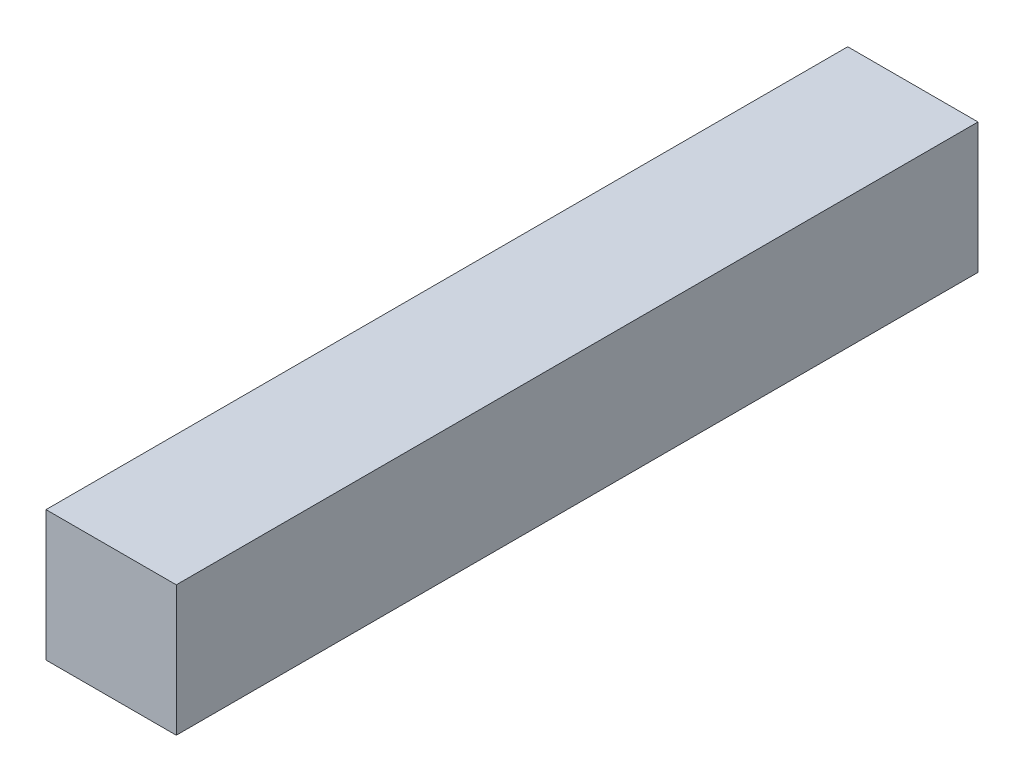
ISO-10303-21;
HEADER;
FILE_DESCRIPTION(('STEP AP214'),'2;1');
FILE_NAME('part.step','',(''),(''),'','','');
FILE_SCHEMA(('AUTOMOTIVE_DESIGN { 1 0 10303 214 1 1 1 1 }'));
ENDSEC;
DATA;
#1=APPLICATION_CONTEXT('core data for automotive mechanical design processes');
#2=APPLICATION_PROTOCOL_DEFINITION('international standard','automotive_design',2000,#1);
#3=PRODUCT_CONTEXT('',#1,'mechanical');
#4=PRODUCT('Part','Part','',(#3));
#5=PRODUCT_RELATED_PRODUCT_CATEGORY('part','',(#4));
#6=PRODUCT_DEFINITION_FORMATION('','',#4);
#7=PRODUCT_DEFINITION_CONTEXT('part definition',#1,'design');
#8=PRODUCT_DEFINITION('design','',#6,#7);
#9=PRODUCT_DEFINITION_SHAPE('','',#8);
#10=(LENGTH_UNIT() NAMED_UNIT(*) SI_UNIT(.MILLI.,.METRE.));
#11=(NAMED_UNIT(*) PLANE_ANGLE_UNIT() SI_UNIT($,.RADIAN.));
#12=(NAMED_UNIT(*) SI_UNIT($,.STERADIAN.) SOLID_ANGLE_UNIT());
#13=UNCERTAINTY_MEASURE_WITH_UNIT(LENGTH_MEASURE(1.E-05),#10,'distance_accuracy_value','');
#14=(GEOMETRIC_REPRESENTATION_CONTEXT(3) GLOBAL_UNCERTAINTY_ASSIGNED_CONTEXT((#13)) GLOBAL_UNIT_ASSIGNED_CONTEXT((#10,
#11,#12)) REPRESENTATION_CONTEXT('',''));
#15=CARTESIAN_POINT('',(0.,0.,0.));
#16=DIRECTION('',(0.,0.,1.));
#17=DIRECTION('',(1.,0.,0.));
#18=AXIS2_PLACEMENT_3D('',#15,#16,#17);
#19=CARTESIAN_POINT('',(-6.5,6.5,40.));
#20=DIRECTION('',(1.,0.,0.));
#21=DIRECTION('',(0.,0.,-1.));
#22=AXIS2_PLACEMENT_3D('',#19,#20,#21);
#23=PLANE('',#22);
#24=DIRECTION('',(0.,-1.,0.));
#25=VECTOR('',#24,1.);
#26=CARTESIAN_POINT('',(-6.5,6.5,-40.));
#27=LINE('',#26,#25);
#28=CARTESIAN_POINT('',(-6.5,6.5,-40.));
#29=VERTEX_POINT('',#28);
#30=CARTESIAN_POINT('',(-6.5,-6.5,-40.));
#31=VERTEX_POINT('',#30);
#32=EDGE_CURVE('E74',#29,#31,#27,.T.);
#33=ORIENTED_EDGE('',*,*,#32,.T.);
#34=DIRECTION('',(0.,0.,-1.));
#35=VECTOR('',#34,1.);
#36=CARTESIAN_POINT('',(-6.5,-6.5,40.));
#37=LINE('',#36,#35);
#38=CARTESIAN_POINT('',(-6.5,-6.5,40.));
#39=VERTEX_POINT('',#38);
#40=EDGE_CURVE('E11',#39,#31,#37,.T.);
#41=ORIENTED_EDGE('',*,*,#40,.F.);
#42=DIRECTION('',(0.,-1.,0.));
#43=VECTOR('',#42,1.);
#44=CARTESIAN_POINT('',(-6.5,6.5,40.));
#45=LINE('',#44,#43);
#46=CARTESIAN_POINT('',(-6.5,6.5,40.));
#47=VERTEX_POINT('',#46);
#48=EDGE_CURVE('E92',#47,#39,#45,.T.);
#49=ORIENTED_EDGE('',*,*,#48,.F.);
#50=DIRECTION('',(0.,0.,-1.));
#51=VECTOR('',#50,1.);
#52=CARTESIAN_POINT('',(-6.5,6.5,40.));
#53=LINE('',#52,#51);
#54=EDGE_CURVE('E86',#47,#29,#53,.T.);
#55=ORIENTED_EDGE('',*,*,#54,.T.);
#56=EDGE_LOOP('',(#33,#41,#49,#55));
#57=FACE_BOUND('',#56,.T.);
#58=ADVANCED_FACE('F30',(#57),#23,.F.);
#59=CARTESIAN_POINT('',(-6.5,-6.5,40.));
#60=DIRECTION('',(0.,1.,0.));
#61=DIRECTION('',(0.,0.,1.));
#62=AXIS2_PLACEMENT_3D('',#59,#60,#61);
#63=PLANE('',#62);
#64=DIRECTION('',(1.,0.,0.));
#65=VECTOR('',#64,1.);
#66=CARTESIAN_POINT('',(-6.5,-6.5,-40.));
#67=LINE('',#66,#65);
#68=CARTESIAN_POINT('',(6.5,-6.5,-40.));
#69=VERTEX_POINT('',#68);
#70=EDGE_CURVE('E70',#31,#69,#67,.T.);
#71=ORIENTED_EDGE('',*,*,#70,.T.);
#72=DIRECTION('',(0.,0.,-1.));
#73=VECTOR('',#72,1.);
#74=CARTESIAN_POINT('',(6.5,-6.5,40.));
#75=LINE('',#74,#73);
#76=CARTESIAN_POINT('',(6.5,-6.5,40.));
#77=VERTEX_POINT('',#76);
#78=EDGE_CURVE('E37',#77,#69,#75,.T.);
#79=ORIENTED_EDGE('',*,*,#78,.F.);
#80=DIRECTION('',(1.,0.,0.));
#81=VECTOR('',#80,1.);
#82=CARTESIAN_POINT('',(-6.5,-6.5,40.));
#83=LINE('',#82,#81);
#84=EDGE_CURVE('E82',#39,#77,#83,.T.);
#85=ORIENTED_EDGE('',*,*,#84,.F.);
#86=ORIENTED_EDGE('',*,*,#40,.T.);
#87=EDGE_LOOP('',(#71,#79,#85,#86));
#88=FACE_BOUND('',#87,.T.);
#89=ADVANCED_FACE('F81',(#88),#63,.F.);
#90=CARTESIAN_POINT('',(6.5,6.5,40.));
#91=DIRECTION('',(-1.,0.,0.));
#92=DIRECTION('',(0.,0.,1.));
#93=AXIS2_PLACEMENT_3D('',#90,#91,#92);
#94=PLANE('',#93);
#95=DIRECTION('',(0.,1.,0.));
#96=VECTOR('',#95,1.);
#97=CARTESIAN_POINT('',(6.5,6.5,-40.));
#98=LINE('',#97,#96);
#99=CARTESIAN_POINT('',(6.5,6.5,-40.));
#100=VERTEX_POINT('',#99);
#101=EDGE_CURVE('E75',#69,#100,#98,.T.);
#102=ORIENTED_EDGE('',*,*,#101,.T.);
#103=DIRECTION('',(0.,0.,-1.));
#104=VECTOR('',#103,1.);
#105=CARTESIAN_POINT('',(6.5,6.5,40.));
#106=LINE('',#105,#104);
#107=CARTESIAN_POINT('',(6.5,6.5,40.));
#108=VERTEX_POINT('',#107);
#109=EDGE_CURVE('E98',#108,#100,#106,.T.);
#110=ORIENTED_EDGE('',*,*,#109,.F.);
#111=DIRECTION('',(0.,1.,0.));
#112=VECTOR('',#111,1.);
#113=CARTESIAN_POINT('',(6.5,6.5,40.));
#114=LINE('',#113,#112);
#115=EDGE_CURVE('E49',#77,#108,#114,.T.);
#116=ORIENTED_EDGE('',*,*,#115,.F.);
#117=ORIENTED_EDGE('',*,*,#78,.T.);
#118=EDGE_LOOP('',(#102,#110,#116,#117));
#119=FACE_BOUND('',#118,.T.);
#120=ADVANCED_FACE('F101',(#119),#94,.F.);
#121=CARTESIAN_POINT('',(-6.5,6.5,40.));
#122=DIRECTION('',(0.,-1.,0.));
#123=DIRECTION('',(0.,0.,-1.));
#124=AXIS2_PLACEMENT_3D('',#121,#122,#123);
#125=PLANE('',#124);
#126=DIRECTION('',(-1.,0.,0.));
#127=VECTOR('',#126,1.);
#128=CARTESIAN_POINT('',(-6.5,6.5,-40.));
#129=LINE('',#128,#127);
#130=EDGE_CURVE('E90',#100,#29,#129,.T.);
#131=ORIENTED_EDGE('',*,*,#130,.T.);
#132=ORIENTED_EDGE('',*,*,#54,.F.);
#133=DIRECTION('',(-1.,0.,0.));
#134=VECTOR('',#133,1.);
#135=CARTESIAN_POINT('',(-6.5,6.5,40.));
#136=LINE('',#135,#134);
#137=EDGE_CURVE('E44',#108,#47,#136,.T.);
#138=ORIENTED_EDGE('',*,*,#137,.F.);
#139=ORIENTED_EDGE('',*,*,#109,.T.);
#140=EDGE_LOOP('',(#131,#132,#138,#139));
#141=FACE_BOUND('',#140,.T.);
#142=ADVANCED_FACE('F103',(#141),#125,.F.);
#143=CARTESIAN_POINT('',(-6.5,-6.5,40.));
#144=DIRECTION('',(0.,0.,1.));
#145=DIRECTION('',(1.,0.,0.));
#146=AXIS2_PLACEMENT_3D('',#143,#144,#145);
#147=PLANE('',#146);
#148=ORIENTED_EDGE('',*,*,#48,.T.);
#149=ORIENTED_EDGE('',*,*,#84,.T.);
#150=ORIENTED_EDGE('',*,*,#115,.T.);
#151=ORIENTED_EDGE('',*,*,#137,.T.);
#152=EDGE_LOOP('',(#148,#149,#150,#151));
#153=FACE_BOUND('',#152,.T.);
#154=ADVANCED_FACE('F104',(#153),#147,.T.);
#155=CARTESIAN_POINT('',(-6.5,-6.5,-40.));
#156=DIRECTION('',(0.,0.,1.));
#157=DIRECTION('',(1.,0.,0.));
#158=AXIS2_PLACEMENT_3D('',#155,#156,#157);
#159=PLANE('',#158);
#160=ORIENTED_EDGE('',*,*,#32,.F.);
#161=ORIENTED_EDGE('',*,*,#130,.F.);
#162=ORIENTED_EDGE('',*,*,#101,.F.);
#163=ORIENTED_EDGE('',*,*,#70,.F.);
#164=EDGE_LOOP('',(#160,#161,#162,#163));
#165=FACE_BOUND('',#164,.T.);
#166=ADVANCED_FACE('F71',(#165),#159,.F.);
#167=CLOSED_SHELL('',(#58,#89,#120,#142,#154,#166));
#168=MANIFOLD_SOLID_BREP('B2',#167);
#169=ADVANCED_BREP_SHAPE_REPRESENTATION('',(#18,#168),#14);
#170=SHAPE_DEFINITION_REPRESENTATION(#9,#169);
ENDSEC;
END-ISO-10303-21;
